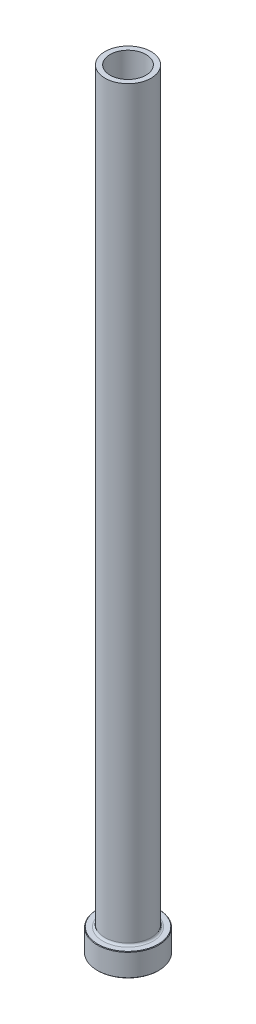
ISO-10303-21;
HEADER;
FILE_DESCRIPTION(('STEP AP214'),'2;1');
FILE_NAME('part.step','',(''),(''),'','','');
FILE_SCHEMA(('AUTOMOTIVE_DESIGN { 1 0 10303 214 1 1 1 1 }'));
ENDSEC;
DATA;
#1=APPLICATION_CONTEXT('core data for automotive mechanical design processes');
#2=APPLICATION_PROTOCOL_DEFINITION('international standard','automotive_design',2000,#1);
#3=PRODUCT_CONTEXT('',#1,'mechanical');
#4=PRODUCT('Part','Part','',(#3));
#5=PRODUCT_RELATED_PRODUCT_CATEGORY('part','',(#4));
#6=PRODUCT_DEFINITION_FORMATION('','',#4);
#7=PRODUCT_DEFINITION_CONTEXT('part definition',#1,'design');
#8=PRODUCT_DEFINITION('design','',#6,#7);
#9=PRODUCT_DEFINITION_SHAPE('','',#8);
#10=(LENGTH_UNIT() NAMED_UNIT(*) SI_UNIT(.MILLI.,.METRE.));
#11=(NAMED_UNIT(*) PLANE_ANGLE_UNIT() SI_UNIT($,.RADIAN.));
#12=(NAMED_UNIT(*) SI_UNIT($,.STERADIAN.) SOLID_ANGLE_UNIT());
#13=UNCERTAINTY_MEASURE_WITH_UNIT(LENGTH_MEASURE(1.E-05),#10,'distance_accuracy_value','');
#14=(GEOMETRIC_REPRESENTATION_CONTEXT(3) GLOBAL_UNCERTAINTY_ASSIGNED_CONTEXT((#13)) GLOBAL_UNIT_ASSIGNED_CONTEXT((#10,
#11,#12)) REPRESENTATION_CONTEXT('',''));
#15=CARTESIAN_POINT('',(0.,0.,0.));
#16=DIRECTION('',(0.,0.,1.));
#17=DIRECTION('',(1.,0.,0.));
#18=AXIS2_PLACEMENT_3D('',#15,#16,#17);
#19=CARTESIAN_POINT('',(0.,92.1876809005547,0.));
#20=DIRECTION('',(0.,1.,0.));
#21=DIRECTION('',(0.,0.,1.));
#22=AXIS2_PLACEMENT_3D('',#19,#20,#21);
#23=CYLINDRICAL_SURFACE('',#22,7.00000000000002);
#24=CARTESIAN_POINT('',(0.,300.,0.));
#25=DIRECTION('',(0.,1.,0.));
#26=DIRECTION('',(0.,0.,1.));
#27=AXIS2_PLACEMENT_3D('',#24,#25,#26);
#28=CIRCLE('',#27,7.00000000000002);
#29=CARTESIAN_POINT('',(0.,300.,7.00000000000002));
#30=VERTEX_POINT('',#29);
#31=EDGE_CURVE('E62',#30,#30,#28,.T.);
#32=ORIENTED_EDGE('',*,*,#31,.T.);
#33=EDGE_LOOP('',(#32));
#34=FACE_BOUND('',#33,.T.);
#35=CARTESIAN_POINT('',(0.,245.,0.));
#36=DIRECTION('',(0.,1.,0.));
#37=DIRECTION('',(0.,0.,1.));
#38=AXIS2_PLACEMENT_3D('',#35,#36,#37);
#39=CIRCLE('',#38,7.00000000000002);
#40=CARTESIAN_POINT('',(0.,245.,7.00000000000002));
#41=VERTEX_POINT('',#40);
#42=EDGE_CURVE('E71',#41,#41,#39,.T.);
#43=ORIENTED_EDGE('',*,*,#42,.F.);
#44=EDGE_LOOP('',(#43));
#45=FACE_BOUND('',#44,.T.);
#46=ADVANCED_FACE('F30',(#34,#45),#23,.F.);
#47=CARTESIAN_POINT('',(-7.00000000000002,300.,0.));
#48=DIRECTION('',(0.,1.,0.));
#49=DIRECTION('',(0.,0.,1.));
#50=AXIS2_PLACEMENT_3D('',#47,#48,#49);
#51=PLANE('',#50);
#52=CARTESIAN_POINT('',(0.,300.,0.));
#53=DIRECTION('',(0.,1.,0.));
#54=DIRECTION('',(0.,0.,1.));
#55=AXIS2_PLACEMENT_3D('',#52,#53,#54);
#56=CIRCLE('',#55,9.00000000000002);
#57=CARTESIAN_POINT('',(0.,300.,9.00000000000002));
#58=VERTEX_POINT('',#57);
#59=EDGE_CURVE('E65',#58,#58,#56,.T.);
#60=ORIENTED_EDGE('',*,*,#59,.T.);
#61=EDGE_LOOP('',(#60));
#62=FACE_BOUND('',#61,.T.);
#63=ORIENTED_EDGE('',*,*,#31,.F.);
#64=EDGE_LOOP('',(#63));
#65=FACE_BOUND('',#64,.T.);
#66=ADVANCED_FACE('F79',(#62,#65),#51,.T.);
#67=CARTESIAN_POINT('',(0.,92.1876809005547,0.));
#68=DIRECTION('',(0.,1.,0.));
#69=DIRECTION('',(0.,0.,1.));
#70=AXIS2_PLACEMENT_3D('',#67,#68,#69);
#71=CYLINDRICAL_SURFACE('',#70,9.00000000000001);
#72=CARTESIAN_POINT('',(0.,9.8,0.));
#73=DIRECTION('',(0.,1.,0.));
#74=DIRECTION('',(0.,0.,1.));
#75=AXIS2_PLACEMENT_3D('',#72,#73,#74);
#76=CIRCLE('',#75,9.00000000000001);
#77=CARTESIAN_POINT('',(0.,9.8,9.00000000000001));
#78=VERTEX_POINT('',#77);
#79=EDGE_CURVE('E59',#78,#78,#76,.T.);
#80=ORIENTED_EDGE('',*,*,#79,.T.);
#81=EDGE_LOOP('',(#80));
#82=FACE_BOUND('',#81,.T.);
#83=ORIENTED_EDGE('',*,*,#59,.F.);
#84=EDGE_LOOP('',(#83));
#85=FACE_BOUND('',#84,.T.);
#86=ADVANCED_FACE('F85',(#82,#85),#71,.T.);
#87=CARTESIAN_POINT('',(-8.99999999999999,9.,0.));
#88=DIRECTION('',(0.,1.,0.));
#89=DIRECTION('',(0.,0.,1.));
#90=AXIS2_PLACEMENT_3D('',#87,#88,#89);
#91=PLANE('',#90);
#92=CARTESIAN_POINT('',(0.,9.,0.));
#93=DIRECTION('',(0.,1.,0.));
#94=DIRECTION('',(0.,0.,1.));
#95=AXIS2_PLACEMENT_3D('',#92,#93,#94);
#96=CIRCLE('',#95,11.8);
#97=CARTESIAN_POINT('',(0.,9.,-11.8));
#98=VERTEX_POINT('',#97);
#99=EDGE_CURVE('E53',#98,#98,#96,.T.);
#100=ORIENTED_EDGE('',*,*,#99,.T.);
#101=EDGE_LOOP('',(#100));
#102=FACE_BOUND('',#101,.T.);
#103=CARTESIAN_POINT('',(0.,9.,0.));
#104=DIRECTION('',(0.,1.,0.));
#105=DIRECTION('',(0.,0.,1.));
#106=AXIS2_PLACEMENT_3D('',#103,#104,#105);
#107=CIRCLE('',#106,9.8);
#108=CARTESIAN_POINT('',(0.,9.,9.8));
#109=VERTEX_POINT('',#108);
#110=EDGE_CURVE('E56',#109,#109,#107,.F.);
#111=ORIENTED_EDGE('',*,*,#110,.T.);
#112=EDGE_LOOP('',(#111));
#113=FACE_BOUND('',#112,.T.);
#114=ADVANCED_FACE('F111',(#102,#113),#91,.T.);
#115=CARTESIAN_POINT('',(0.,92.1876809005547,0.));
#116=DIRECTION('',(0.,1.,0.));
#117=DIRECTION('',(0.,0.,1.));
#118=AXIS2_PLACEMENT_3D('',#115,#116,#117);
#119=CYLINDRICAL_SURFACE('',#118,12.);
#120=CARTESIAN_POINT('',(0.,8.80000000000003,0.));
#121=DIRECTION('',(0.,1.,0.));
#122=DIRECTION('',(0.,0.,1.));
#123=AXIS2_PLACEMENT_3D('',#120,#121,#122);
#124=CIRCLE('',#123,12.);
#125=CARTESIAN_POINT('',(0.,8.80000000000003,-12.));
#126=VERTEX_POINT('',#125);
#127=EDGE_CURVE('E45',#126,#126,#124,.F.);
#128=ORIENTED_EDGE('',*,*,#127,.T.);
#129=EDGE_LOOP('',(#128));
#130=FACE_BOUND('',#129,.T.);
#131=CARTESIAN_POINT('',(0.,0.200000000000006,0.));
#132=DIRECTION('',(0.,-1.,0.));
#133=DIRECTION('',(0.,0.,-1.));
#134=AXIS2_PLACEMENT_3D('',#131,#132,#133);
#135=CIRCLE('',#134,12.);
#136=CARTESIAN_POINT('',(0.,0.200000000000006,-12.));
#137=VERTEX_POINT('',#136);
#138=EDGE_CURVE('E50',#137,#137,#135,.F.);
#139=ORIENTED_EDGE('',*,*,#138,.T.);
#140=EDGE_LOOP('',(#139));
#141=FACE_BOUND('',#140,.T.);
#142=ADVANCED_FACE('F108',(#130,#141),#119,.T.);
#143=CARTESIAN_POINT('',(-12.,0.,0.));
#144=DIRECTION('',(0.,-1.,0.));
#145=DIRECTION('',(0.,0.,-1.));
#146=AXIS2_PLACEMENT_3D('',#143,#144,#145);
#147=PLANE('',#146);
#148=CARTESIAN_POINT('',(0.,0.,0.));
#149=DIRECTION('',(0.,-1.,0.));
#150=DIRECTION('',(0.,0.,-1.));
#151=AXIS2_PLACEMENT_3D('',#148,#149,#150);
#152=CIRCLE('',#151,7.75000000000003);
#153=CARTESIAN_POINT('',(0.,0.,-7.75000000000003));
#154=VERTEX_POINT('',#153);
#155=EDGE_CURVE('E37',#154,#154,#152,.F.);
#156=ORIENTED_EDGE('',*,*,#155,.T.);
#157=EDGE_LOOP('',(#156));
#158=FACE_BOUND('',#157,.T.);
#159=CARTESIAN_POINT('',(0.,0.,0.));
#160=DIRECTION('',(0.,-1.,0.));
#161=DIRECTION('',(0.,0.,-1.));
#162=AXIS2_PLACEMENT_3D('',#159,#160,#161);
#163=CIRCLE('',#162,11.8);
#164=CARTESIAN_POINT('',(0.,0.,-11.8));
#165=VERTEX_POINT('',#164);
#166=EDGE_CURVE('E41',#165,#165,#163,.T.);
#167=ORIENTED_EDGE('',*,*,#166,.T.);
#168=EDGE_LOOP('',(#167));
#169=FACE_BOUND('',#168,.T.);
#170=ADVANCED_FACE('F110',(#158,#169),#147,.T.);
#171=CARTESIAN_POINT('',(0.,92.1876809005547,0.));
#172=DIRECTION('',(0.,1.,0.));
#173=DIRECTION('',(0.,0.,1.));
#174=AXIS2_PLACEMENT_3D('',#171,#172,#173);
#175=CYLINDRICAL_SURFACE('',#174,7.25);
#176=CARTESIAN_POINT('',(0.,0.5,0.));
#177=DIRECTION('',(0.,-1.,0.));
#178=DIRECTION('',(0.,0.,-1.));
#179=AXIS2_PLACEMENT_3D('',#176,#177,#178);
#180=CIRCLE('',#179,7.25);
#181=CARTESIAN_POINT('',(0.,0.5,-7.25));
#182=VERTEX_POINT('',#181);
#183=EDGE_CURVE('E10',#182,#182,#180,.T.);
#184=ORIENTED_EDGE('',*,*,#183,.T.);
#185=EDGE_LOOP('',(#184));
#186=FACE_BOUND('',#185,.T.);
#187=CARTESIAN_POINT('',(0.,233.,0.));
#188=DIRECTION('',(0.,1.,0.));
#189=DIRECTION('',(0.,0.,1.));
#190=AXIS2_PLACEMENT_3D('',#187,#188,#189);
#191=CIRCLE('',#190,7.25000000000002);
#192=CARTESIAN_POINT('',(0.,233.,7.25000000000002));
#193=VERTEX_POINT('',#192);
#194=EDGE_CURVE('E68',#193,#193,#191,.T.);
#195=ORIENTED_EDGE('',*,*,#194,.T.);
#196=EDGE_LOOP('',(#195));
#197=FACE_BOUND('',#196,.T.);
#198=ADVANCED_FACE('F118',(#186,#197),#175,.F.);
#199=CARTESIAN_POINT('',(0.,233.,0.));
#200=DIRECTION('',(0.,-1.,0.));
#201=DIRECTION('',(0.,0.,-1.));
#202=AXIS2_PLACEMENT_3D('',#199,#200,#201);
#203=CONICAL_SURFACE('',#202,7.25000000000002,0.0208303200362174);
#204=ORIENTED_EDGE('',*,*,#42,.T.);
#205=EDGE_LOOP('',(#204));
#206=FACE_BOUND('',#205,.T.);
#207=ORIENTED_EDGE('',*,*,#194,.F.);
#208=EDGE_LOOP('',(#207));
#209=FACE_BOUND('',#208,.T.);
#210=ADVANCED_FACE('F75',(#206,#209),#203,.F.);
#211=CARTESIAN_POINT('',(0.,9.8,0.));
#212=DIRECTION('',(0.,1.,0.));
#213=DIRECTION('',(0.,0.,1.));
#214=AXIS2_PLACEMENT_3D('',#211,#212,#213);
#215=TOROIDAL_SURFACE('',#214,9.8,0.8);
#216=ORIENTED_EDGE('',*,*,#110,.F.);
#217=EDGE_LOOP('',(#216));
#218=FACE_BOUND('',#217,.T.);
#219=ORIENTED_EDGE('',*,*,#79,.F.);
#220=EDGE_LOOP('',(#219));
#221=FACE_BOUND('',#220,.T.);
#222=ADVANCED_FACE('F90',(#218,#221),#215,.F.);
#223=CARTESIAN_POINT('',(0.,9.00000000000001,0.));
#224=DIRECTION('',(0.,-1.,0.));
#225=DIRECTION('',(0.,0.,-1.));
#226=AXIS2_PLACEMENT_3D('',#223,#224,#225);
#227=CONICAL_SURFACE('',#226,11.8,0.785398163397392);
#228=CARTESIAN_POINT('',(0.,8.80000000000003,-12.));
#229=CARTESIAN_POINT('',(0.,8.80208333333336,-11.9979166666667));
#230=CARTESIAN_POINT('',(0.,8.80416666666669,-11.9958333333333));
#231=CARTESIAN_POINT('',(0.,8.80833333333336,-11.9916666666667));
#232=CARTESIAN_POINT('',(0.,8.81041666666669,-11.9895833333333));
#233=CARTESIAN_POINT('',(0.,8.81458333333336,-11.9854166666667));
#234=CARTESIAN_POINT('',(0.,8.81666666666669,-11.9833333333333));
#235=CARTESIAN_POINT('',(0.,8.82083333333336,-11.9791666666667));
#236=CARTESIAN_POINT('',(0.,8.82291666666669,-11.9770833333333));
#237=CARTESIAN_POINT('',(0.,8.82708333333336,-11.9729166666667));
#238=CARTESIAN_POINT('',(0.,8.82916666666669,-11.9708333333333));
#239=CARTESIAN_POINT('',(0.,8.83333333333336,-11.9666666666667));
#240=CARTESIAN_POINT('',(0.,8.83541666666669,-11.9645833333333));
#241=CARTESIAN_POINT('',(0.,8.83958333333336,-11.9604166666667));
#242=CARTESIAN_POINT('',(0.,8.84166666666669,-11.9583333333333));
#243=CARTESIAN_POINT('',(0.,8.84583333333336,-11.9541666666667));
#244=CARTESIAN_POINT('',(0.,8.84791666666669,-11.9520833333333));
#245=CARTESIAN_POINT('',(0.,8.85208333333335,-11.9479166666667));
#246=CARTESIAN_POINT('',(0.,8.85416666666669,-11.9458333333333));
#247=CARTESIAN_POINT('',(0.,8.85833333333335,-11.9416666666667));
#248=CARTESIAN_POINT('',(0.,8.86041666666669,-11.9395833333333));
#249=CARTESIAN_POINT('',(0.,8.86458333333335,-11.9354166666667));
#250=CARTESIAN_POINT('',(0.,8.86666666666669,-11.9333333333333));
#251=CARTESIAN_POINT('',(0.,8.87083333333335,-11.9291666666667));
#252=CARTESIAN_POINT('',(0.,8.87291666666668,-11.9270833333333));
#253=CARTESIAN_POINT('',(0.,8.87708333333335,-11.9229166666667));
#254=CARTESIAN_POINT('',(0.,8.87916666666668,-11.9208333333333));
#255=CARTESIAN_POINT('',(0.,8.88333333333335,-11.9166666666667));
#256=CARTESIAN_POINT('',(0.,8.88541666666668,-11.9145833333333));
#257=CARTESIAN_POINT('',(0.,8.88958333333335,-11.9104166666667));
#258=CARTESIAN_POINT('',(0.,8.89166666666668,-11.9083333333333));
#259=CARTESIAN_POINT('',(0.,8.89583333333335,-11.9041666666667));
#260=CARTESIAN_POINT('',(0.,8.89791666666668,-11.9020833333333));
#261=CARTESIAN_POINT('',(0.,8.90208333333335,-11.8979166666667));
#262=CARTESIAN_POINT('',(0.,8.90416666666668,-11.8958333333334));
#263=CARTESIAN_POINT('',(0.,8.90833333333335,-11.8916666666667));
#264=CARTESIAN_POINT('',(0.,8.91041666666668,-11.8895833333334));
#265=CARTESIAN_POINT('',(0.,8.91458333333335,-11.8854166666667));
#266=CARTESIAN_POINT('',(0.,8.91666666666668,-11.8833333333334));
#267=CARTESIAN_POINT('',(0.,8.92083333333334,-11.8791666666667));
#268=CARTESIAN_POINT('',(0.,8.92291666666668,-11.8770833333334));
#269=CARTESIAN_POINT('',(0.,8.92708333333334,-11.8729166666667));
#270=CARTESIAN_POINT('',(0.,8.92916666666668,-11.8708333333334));
#271=CARTESIAN_POINT('',(0.,8.93333333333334,-11.8666666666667));
#272=CARTESIAN_POINT('',(0.,8.93541666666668,-11.8645833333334));
#273=CARTESIAN_POINT('',(0.,8.93958333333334,-11.8604166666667));
#274=CARTESIAN_POINT('',(0.,8.94166666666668,-11.8583333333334));
#275=CARTESIAN_POINT('',(0.,8.94583333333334,-11.8541666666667));
#276=CARTESIAN_POINT('',(0.,8.94791666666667,-11.8520833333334));
#277=CARTESIAN_POINT('',(0.,8.95208333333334,-11.8479166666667));
#278=CARTESIAN_POINT('',(0.,8.95416666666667,-11.8458333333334));
#279=CARTESIAN_POINT('',(0.,8.95833333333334,-11.8416666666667));
#280=CARTESIAN_POINT('',(0.,8.96041666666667,-11.8395833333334));
#281=CARTESIAN_POINT('',(0.,8.96458333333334,-11.8354166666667));
#282=CARTESIAN_POINT('',(0.,8.96666666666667,-11.8333333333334));
#283=CARTESIAN_POINT('',(0.,8.97083333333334,-11.8291666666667));
#284=CARTESIAN_POINT('',(0.,8.97291666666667,-11.8270833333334));
#285=CARTESIAN_POINT('',(0.,8.97708333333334,-11.8229166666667));
#286=CARTESIAN_POINT('',(0.,8.97916666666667,-11.8208333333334));
#287=CARTESIAN_POINT('',(0.,8.98333333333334,-11.8166666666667));
#288=CARTESIAN_POINT('',(0.,8.98541666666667,-11.8145833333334));
#289=CARTESIAN_POINT('',(0.,8.98958333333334,-11.8104166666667));
#290=CARTESIAN_POINT('',(0.,8.99166666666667,-11.8083333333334));
#291=CARTESIAN_POINT('',(0.,8.99583333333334,-11.8041666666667));
#292=CARTESIAN_POINT('',(0.,8.99791666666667,-11.8020833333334));
#293=CARTESIAN_POINT('',(0.,9.,-11.8));
#294=B_SPLINE_CURVE_WITH_KNOTS('',3,(#228,#229,#230,#231,#232,#233,#234,#235,#236,#237,#238,
#239,#240,#241,#242,#243,#244,#245,#246,#247,#248,#249,#250,#251,#252,#253,#254,#255,#256,#257,
#258,#259,#260,#261,#262,#263,#264,#265,#266,#267,#268,#269,#270,#271,#272,#273,#274,#275,#276,
#277,#278,#279,#280,#281,#282,#283,#284,#285,#286,#287,#288,#289,#290,#291,#292,#293),
.UNSPECIFIED.,.F.,.F.,(4,2,2,2,2,2,2,2,2,2,2,2,2,2,2,2,2,2,2,2,2,2,2,2,2,2,2,2,2,2,2,2,4),(0.,
0.00883883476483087,0.0176776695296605,0.0265165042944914,0.035355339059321,0.0441941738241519,
0.0530330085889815,0.0618718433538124,0.0707106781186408,0.0795495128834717,0.0883883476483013,
0.0972271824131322,0.106066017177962,0.114904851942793,0.123743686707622,0.132582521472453,
0.141421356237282,0.150260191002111,0.159099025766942,0.167937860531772,0.176776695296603,
0.185615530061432,0.194454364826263,0.203293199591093,0.212132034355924,0.220970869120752,
0.229809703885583,0.238648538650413,0.247487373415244,0.256326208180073,0.265165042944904,
0.274003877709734,0.282842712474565),.UNSPECIFIED.);
#295=EDGE_CURVE('BSEAM93',#126,#98,#294,.T.);
#296=ORIENTED_EDGE('',*,*,#127,.F.);
#297=ORIENTED_EDGE('',*,*,#99,.F.);
#298=ORIENTED_EDGE('',*,*,#295,.T.);
#299=ORIENTED_EDGE('',*,*,#295,.F.);
#300=EDGE_LOOP('',(#296,#298,#297,#299));
#301=FACE_BOUND('',#300,.T.);
#302=ADVANCED_FACE('F93',(#301),#227,.T.);
#303=CARTESIAN_POINT('',(0.,0.200000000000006,0.));
#304=DIRECTION('',(0.,1.,0.));
#305=DIRECTION('',(0.,0.,1.));
#306=AXIS2_PLACEMENT_3D('',#303,#304,#305);
#307=CONICAL_SURFACE('',#306,12.,0.785398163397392);
#308=ORIENTED_EDGE('',*,*,#166,.F.);
#309=EDGE_LOOP('',(#308));
#310=FACE_BOUND('',#309,.T.);
#311=ORIENTED_EDGE('',*,*,#138,.F.);
#312=EDGE_LOOP('',(#311));
#313=FACE_BOUND('',#312,.T.);
#314=ADVANCED_FACE('F96',(#310,#313),#307,.T.);
#315=CARTESIAN_POINT('',(0.,0.,0.));
#316=DIRECTION('',(0.,-1.,0.));
#317=DIRECTION('',(0.,0.,-1.));
#318=AXIS2_PLACEMENT_3D('',#315,#316,#317);
#319=CONICAL_SURFACE('',#318,7.75000000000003,0.785398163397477);
#320=ORIENTED_EDGE('',*,*,#183,.F.);
#321=EDGE_LOOP('',(#320));
#322=FACE_BOUND('',#321,.T.);
#323=ORIENTED_EDGE('',*,*,#155,.F.);
#324=EDGE_LOOP('',(#323));
#325=FACE_BOUND('',#324,.T.);
#326=ADVANCED_FACE('F32',(#322,#325),#319,.F.);
#327=CLOSED_SHELL('',(#46,#66,#86,#114,#142,#170,#198,#210,#222,#302,#314,#326));
#328=MANIFOLD_SOLID_BREP('B2',#327);
#329=ADVANCED_BREP_SHAPE_REPRESENTATION('',(#18,#328),#14);
#330=SHAPE_DEFINITION_REPRESENTATION(#9,#329);
ENDSEC;
END-ISO-10303-21;
